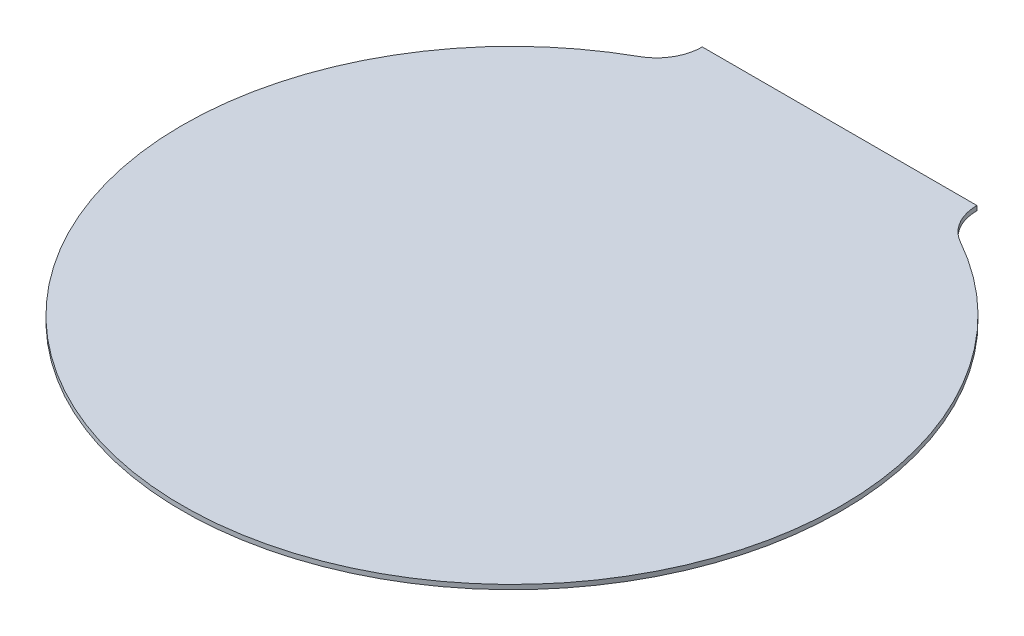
from build123d import *

# Parameters (mm, degrees)
EXTRUDE1_DEPTH = 0.127


with BuildPart() as part:
    # Sketch1 → Extrude1 (new body)
    with BuildSketch(Plane(origin=(0, 0, 0), x_dir=(1, 0, 0), z_dir=(0, 1, 0))):
        with BuildLine():
            Line((3.8096924, 9.091101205), (-3.8096924, 9.091101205))
            ThreePointArc((-3.8096924, 9.091101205), (-3.984331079, 8.448385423), (-4.460217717, 7.982430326))
            ThreePointArc((-4.460217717, 7.982430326), (0, -9.144), (4.460217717, 7.982430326))
            ThreePointArc((4.460217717, 7.982430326), (3.984331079, 8.448385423), (3.8096924, 9.091101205))
        make_face()
    extrude(amount=EXTRUDE1_DEPTH)


solid = part.part
